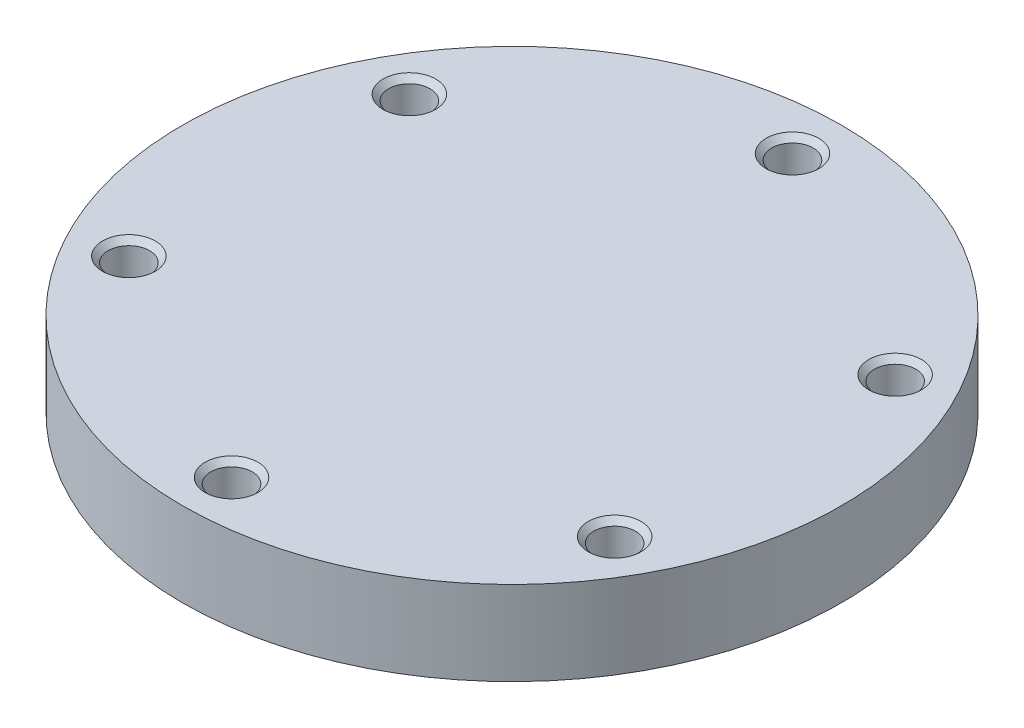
from build123d import *

# Parameters (mm, degrees)
SKETCH1_R                            = 37.30625
BOSS_EXTRUDE1_DEPTH                  = 9.525
F_13_0_185_DIAMETER_HOLE1_AT_2_COUNT = 2
F_13_0_185_DIAMETER_HOLE1_AT_2_PITCH = 31.75
F_13_0_185_DIAMETER_HOLE1_AT_3_COUNT = 2
F_13_0_185_DIAMETER_HOLE1_AT_3_PITCH = 54.99261314
F_13_0_185_DIAMETER_HOLE1_AT_4_COUNT = 2
F_13_0_185_DIAMETER_HOLE1_AT_4_PITCH = 63.5
F_13_0_185_DIAMETER_HOLE1_AT_5_COUNT = 2
F_13_0_185_DIAMETER_HOLE1_AT_5_PITCH = 54.99261314
F_13_0_185_DIAMETER_HOLE1_AT_6_COUNT = 2
F_13_0_185_DIAMETER_HOLE1_AT_6_PITCH = 31.75
SKETCH4_R                            = 27.6987
SKETCH4_R_2                          = 23.6093
CUT_EXTRUDE1_DEPTH                   = 2.6416


with BuildPart() as part:
    # Sketch1 → Boss-Extrude1 (new body)
    with BuildSketch(Plane(origin=(0, 0, 0), x_dir=(1, 0, 0), z_dir=(0, 1, 0))):
        with Locations(Location((0, 0, 0), (0, 0, 90))):
            Circle(SKETCH1_R)
    extrude(amount=BOSS_EXTRUDE1_DEPTH)

    # Sketch3 → 13 _0.185_ Diameter Hole1 (revolve, cut)
    with BuildSketch(Plane(origin=(0, 9.525, -31.75), x_dir=(0, 0, 1), z_dir=(1, 0, 0))):
        Polygon((0, 0), (0, 9.525), (2.9845, 9.525), (2.3495, 8.89), (2.3495, 0.635), (2.9845, 0), align=None)
    f_13_0_185_diameter_hole1 = revolve(axis=Axis((0, 15.875, -31.75), (0, -1, 0)), mode=Mode.SUBTRACT)

    # 13 _0.185_ Diameter Hole1 at 2: 13 _0.185_ Diameter Hole1 ×2
    with Locations(*[Vector(0.866025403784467, 0, 0.4999999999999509) * (i * F_13_0_185_DIAMETER_HOLE1_AT_2_PITCH) for i in range(1, F_13_0_185_DIAMETER_HOLE1_AT_2_COUNT)]):
        add(f_13_0_185_diameter_hole1, mode=Mode.SUBTRACT)

    # 13 _0.185_ Diameter Hole1 at 3: 13 _0.185_ Diameter Hole1 ×2
    with Locations(*[Vector(0.5000000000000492, 0, 0.8660254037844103) * (i * F_13_0_185_DIAMETER_HOLE1_AT_3_PITCH) for i in range(1, F_13_0_185_DIAMETER_HOLE1_AT_3_COUNT)]):
        add(f_13_0_185_diameter_hole1, mode=Mode.SUBTRACT)

    # 13 _0.185_ Diameter Hole1 at 4: 13 _0.185_ Diameter Hole1 ×2
    with Locations(*[(0, 0, i * F_13_0_185_DIAMETER_HOLE1_AT_4_PITCH) for i in range(1, F_13_0_185_DIAMETER_HOLE1_AT_4_COUNT)]):
        add(f_13_0_185_diameter_hole1, mode=Mode.SUBTRACT)

    # 13 _0.185_ Diameter Hole1 at 5: 13 _0.185_ Diameter Hole1 ×2
    with Locations(*[Vector(-0.4999999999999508, 0, 0.8660254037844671) * (i * F_13_0_185_DIAMETER_HOLE1_AT_5_PITCH) for i in range(1, F_13_0_185_DIAMETER_HOLE1_AT_5_COUNT)]):
        add(f_13_0_185_diameter_hole1, mode=Mode.SUBTRACT)

    # 13 _0.185_ Diameter Hole1 at 6: 13 _0.185_ Diameter Hole1 ×2
    with Locations(*[Vector(-0.8660254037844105, 0, 0.500000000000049) * (i * F_13_0_185_DIAMETER_HOLE1_AT_6_PITCH) for i in range(1, F_13_0_185_DIAMETER_HOLE1_AT_6_COUNT)]):
        add(f_13_0_185_diameter_hole1, mode=Mode.SUBTRACT)

    # Sketch4 → Cut-Extrude1 (cut)
    with BuildSketch(Plane.XZ):
        with Locations(Location((0, 0, 0), (0, 0, 270))):
            Circle(SKETCH4_R)
        with Locations(Location((0, 0, 0), (0, 0, 270))):
            Circle(SKETCH4_R_2, mode=Mode.SUBTRACT)
    extrude(amount=-CUT_EXTRUDE1_DEPTH, mode=Mode.SUBTRACT)


solid = part.part
